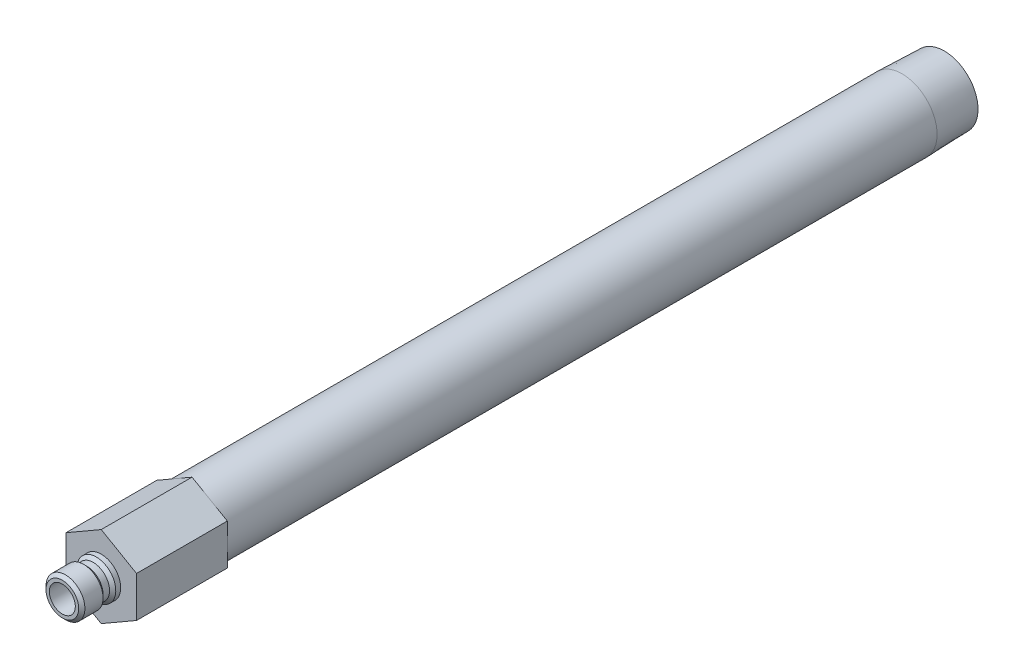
ISO-10303-21;
HEADER;
FILE_DESCRIPTION(('STEP AP214'),'2;1');
FILE_NAME('part.step','',(''),(''),'','','');
FILE_SCHEMA(('AUTOMOTIVE_DESIGN { 1 0 10303 214 1 1 1 1 }'));
ENDSEC;
DATA;
#1=APPLICATION_CONTEXT('core data for automotive mechanical design processes');
#2=APPLICATION_PROTOCOL_DEFINITION('international standard','automotive_design',2000,#1);
#3=PRODUCT_CONTEXT('',#1,'mechanical');
#4=PRODUCT('Part','Part','',(#3));
#5=PRODUCT_RELATED_PRODUCT_CATEGORY('part','',(#4));
#6=PRODUCT_DEFINITION_FORMATION('','',#4);
#7=PRODUCT_DEFINITION_CONTEXT('part definition',#1,'design');
#8=PRODUCT_DEFINITION('design','',#6,#7);
#9=PRODUCT_DEFINITION_SHAPE('','',#8);
#10=(LENGTH_UNIT() NAMED_UNIT(*) SI_UNIT(.MILLI.,.METRE.));
#11=(NAMED_UNIT(*) PLANE_ANGLE_UNIT() SI_UNIT($,.RADIAN.));
#12=(NAMED_UNIT(*) SI_UNIT($,.STERADIAN.) SOLID_ANGLE_UNIT());
#13=UNCERTAINTY_MEASURE_WITH_UNIT(LENGTH_MEASURE(1.E-05),#10,'distance_accuracy_value','');
#14=(GEOMETRIC_REPRESENTATION_CONTEXT(3) GLOBAL_UNCERTAINTY_ASSIGNED_CONTEXT((#13)) GLOBAL_UNIT_ASSIGNED_CONTEXT((#10,
#11,#12)) REPRESENTATION_CONTEXT('',''));
#15=CARTESIAN_POINT('',(0.,0.,0.));
#16=DIRECTION('',(0.,0.,1.));
#17=DIRECTION('',(1.,0.,0.));
#18=AXIS2_PLACEMENT_3D('',#15,#16,#17);
#19=CARTESIAN_POINT('',(0.,0.,0.));
#20=DIRECTION('',(0.,0.,-1.));
#21=DIRECTION('',(0.,1.,0.));
#22=AXIS2_PLACEMENT_3D('',#19,#20,#21);
#23=CYLINDRICAL_SURFACE('',#22,8.57249999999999);
#24=CARTESIAN_POINT('',(0.,0.,-196.0372));
#25=DIRECTION('',(0.,0.,-1.));
#26=DIRECTION('',(0.,1.,0.));
#27=AXIS2_PLACEMENT_3D('',#24,#25,#26);
#28=CIRCLE('',#27,8.57249999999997);
#29=CARTESIAN_POINT('',(0.,8.5725,-196.0372));
#30=VERTEX_POINT('',#29);
#31=EDGE_CURVE('E168',#30,#30,#28,.T.);
#32=ORIENTED_EDGE('',*,*,#31,.F.);
#33=EDGE_LOOP('',(#32));
#34=FACE_BOUND('',#33,.T.);
#35=CARTESIAN_POINT('',(0.,0.,-22.225));
#36=DIRECTION('',(0.,0.,1.));
#37=DIRECTION('',(1.,0.,0.));
#38=AXIS2_PLACEMENT_3D('',#35,#36,#37);
#39=CIRCLE('',#38,8.57249999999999);
#40=CARTESIAN_POINT('',(8.57249999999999,0.,-22.225));
#41=VERTEX_POINT('',#40);
#42=EDGE_CURVE('E37',#41,#41,#39,.F.);
#43=ORIENTED_EDGE('',*,*,#42,.T.);
#44=EDGE_LOOP('',(#43));
#45=FACE_BOUND('',#44,.T.);
#46=ADVANCED_FACE('F33',(#34,#45),#23,.T.);
#47=CARTESIAN_POINT('',(0.,0.,0.));
#48=DIRECTION('',(0.,0.,-1.));
#49=DIRECTION('',(0.,1.,0.));
#50=AXIS2_PLACEMENT_3D('',#47,#48,#49);
#51=CYLINDRICAL_SURFACE('',#50,3.175);
#52=CARTESIAN_POINT('',(0.,0.,9.525));
#53=DIRECTION('',(0.,0.,-1.));
#54=DIRECTION('',(0.,1.,0.));
#55=AXIS2_PLACEMENT_3D('',#52,#53,#54);
#56=CIRCLE('',#55,3.175);
#57=CARTESIAN_POINT('',(0.,3.175,9.525));
#58=VERTEX_POINT('',#57);
#59=EDGE_CURVE('E144',#58,#58,#56,.T.);
#60=ORIENTED_EDGE('',*,*,#59,.F.);
#61=EDGE_LOOP('',(#60));
#62=FACE_BOUND('',#61,.T.);
#63=CARTESIAN_POINT('',(0.,0.,-22.225));
#64=DIRECTION('',(0.,0.,-1.));
#65=DIRECTION('',(0.,1.,0.));
#66=AXIS2_PLACEMENT_3D('',#63,#64,#65);
#67=CIRCLE('',#66,3.17499999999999);
#68=CARTESIAN_POINT('',(0.,3.175,-22.225));
#69=VERTEX_POINT('',#68);
#70=EDGE_CURVE('E11',#69,#69,#67,.T.);
#71=ORIENTED_EDGE('',*,*,#70,.T.);
#72=EDGE_LOOP('',(#71));
#73=FACE_BOUND('',#72,.T.);
#74=ADVANCED_FACE('F35',(#62,#73),#51,.F.);
#75=CARTESIAN_POINT('',(0.,3.175,-22.225));
#76=DIRECTION('',(0.,0.,-1.));
#77=DIRECTION('',(0.,1.,0.));
#78=AXIS2_PLACEMENT_3D('',#75,#76,#77);
#79=PLANE('',#78);
#80=CARTESIAN_POINT('',(0.,0.,-22.225));
#81=DIRECTION('',(0.,0.,-1.));
#82=DIRECTION('',(0.,1.,0.));
#83=AXIS2_PLACEMENT_3D('',#80,#81,#82);
#84=CIRCLE('',#83,6.2611);
#85=CARTESIAN_POINT('',(0.,6.2611,-22.225));
#86=VERTEX_POINT('',#85);
#87=EDGE_CURVE('E43',#86,#86,#84,.T.);
#88=ORIENTED_EDGE('',*,*,#87,.T.);
#89=EDGE_LOOP('',(#88));
#90=FACE_BOUND('',#89,.T.);
#91=ORIENTED_EDGE('',*,*,#70,.F.);
#92=EDGE_LOOP('',(#91));
#93=FACE_BOUND('',#92,.T.);
#94=ADVANCED_FACE('F180',(#90,#93),#79,.T.);
#95=CARTESIAN_POINT('',(0.,0.,0.));
#96=DIRECTION('',(0.,0.,-1.));
#97=DIRECTION('',(0.,1.,0.));
#98=AXIS2_PLACEMENT_3D('',#95,#96,#97);
#99=CYLINDRICAL_SURFACE('',#98,6.26109999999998);
#100=CARTESIAN_POINT('',(0.,0.,-206.375));
#101=DIRECTION('',(0.,0.,-1.));
#102=DIRECTION('',(0.,1.,0.));
#103=AXIS2_PLACEMENT_3D('',#100,#101,#102);
#104=CIRCLE('',#103,6.26109999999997);
#105=CARTESIAN_POINT('',(0.,6.2611,-206.375));
#106=VERTEX_POINT('',#105);
#107=EDGE_CURVE('E174',#106,#106,#104,.T.);
#108=ORIENTED_EDGE('',*,*,#107,.T.);
#109=EDGE_LOOP('',(#108));
#110=FACE_BOUND('',#109,.T.);
#111=ORIENTED_EDGE('',*,*,#87,.F.);
#112=EDGE_LOOP('',(#111));
#113=FACE_BOUND('',#112,.T.);
#114=ADVANCED_FACE('F183',(#110,#113),#99,.F.);
#115=CARTESIAN_POINT('',(0.,8.24944566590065,-206.375));
#116=DIRECTION('',(0.,0.,-1.));
#117=DIRECTION('',(0.,1.,0.));
#118=AXIS2_PLACEMENT_3D('',#115,#116,#117);
#119=PLANE('',#118);
#120=CARTESIAN_POINT('',(0.,0.,-206.375));
#121=DIRECTION('',(0.,0.,-1.));
#122=DIRECTION('',(0.,1.,0.));
#123=AXIS2_PLACEMENT_3D('',#120,#121,#122);
#124=CIRCLE('',#123,8.24944566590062);
#125=CARTESIAN_POINT('',(0.,8.24944566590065,-206.375));
#126=VERTEX_POINT('',#125);
#127=EDGE_CURVE('E171',#126,#126,#124,.T.);
#128=ORIENTED_EDGE('',*,*,#127,.T.);
#129=EDGE_LOOP('',(#128));
#130=FACE_BOUND('',#129,.T.);
#131=ORIENTED_EDGE('',*,*,#107,.F.);
#132=EDGE_LOOP('',(#131));
#133=FACE_BOUND('',#132,.T.);
#134=ADVANCED_FACE('F185',(#130,#133),#119,.T.);
#135=CARTESIAN_POINT('',(0.,0.,-206.375));
#136=DIRECTION('',(0.,0.,1.));
#137=DIRECTION('',(0.,-1.,0.));
#138=AXIS2_PLACEMENT_3D('',#135,#136,#137);
#139=CONICAL_SURFACE('',#138,8.24944566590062,0.0312396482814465);
#140=ORIENTED_EDGE('',*,*,#31,.T.);
#141=EDGE_LOOP('',(#140));
#142=FACE_BOUND('',#141,.T.);
#143=ORIENTED_EDGE('',*,*,#127,.F.);
#144=EDGE_LOOP('',(#143));
#145=FACE_BOUND('',#144,.T.);
#146=ADVANCED_FACE('F192',(#142,#145),#139,.T.);
#147=CARTESIAN_POINT('',(0.,4.7625,0.));
#148=DIRECTION('',(0.,0.,1.));
#149=DIRECTION('',(0.,-1.,0.));
#150=AXIS2_PLACEMENT_3D('',#147,#148,#149);
#151=PLANE('',#150);
#152=CARTESIAN_POINT('',(0.,0.,0.));
#153=DIRECTION('',(0.,0.,-1.));
#154=DIRECTION('',(0.,1.,0.));
#155=AXIS2_PLACEMENT_3D('',#152,#153,#154);
#156=CIRCLE('',#155,4.7625);
#157=CARTESIAN_POINT('',(0.,4.7625,0.));
#158=VERTEX_POINT('',#157);
#159=EDGE_CURVE('E165',#158,#158,#156,.T.);
#160=ORIENTED_EDGE('',*,*,#159,.T.);
#161=EDGE_LOOP('',(#160));
#162=FACE_BOUND('',#161,.T.);
#163=DIRECTION('',(-0.866025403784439,-0.5,0.));
#164=VECTOR('',#163,1.);
#165=CARTESIAN_POINT('',(0.,9.97199384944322,0.));
#166=LINE('',#165,#164);
#167=CARTESIAN_POINT('',(0.,9.97199384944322,0.));
#168=VERTEX_POINT('',#167);
#169=CARTESIAN_POINT('',(-8.636,4.98599692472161,0.));
#170=VERTEX_POINT('',#169);
#171=EDGE_CURVE('E122',#168,#170,#166,.T.);
#172=ORIENTED_EDGE('',*,*,#171,.T.);
#173=DIRECTION('',(0.,-1.,0.));
#174=VECTOR('',#173,1.);
#175=CARTESIAN_POINT('',(-8.636,4.98599692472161,0.));
#176=LINE('',#175,#174);
#177=CARTESIAN_POINT('',(-8.636,-4.98599692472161,0.));
#178=VERTEX_POINT('',#177);
#179=EDGE_CURVE('E125',#170,#178,#176,.T.);
#180=ORIENTED_EDGE('',*,*,#179,.T.);
#181=DIRECTION('',(0.866025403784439,-0.5,0.));
#182=VECTOR('',#181,1.);
#183=CARTESIAN_POINT('',(-8.636,-4.98599692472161,0.));
#184=LINE('',#183,#182);
#185=CARTESIAN_POINT('',(0.,-9.97199384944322,0.));
#186=VERTEX_POINT('',#185);
#187=EDGE_CURVE('E128',#178,#186,#184,.T.);
#188=ORIENTED_EDGE('',*,*,#187,.T.);
#189=DIRECTION('',(0.866025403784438,0.5,0.));
#190=VECTOR('',#189,1.);
#191=CARTESIAN_POINT('',(0.,-9.97199384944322,0.));
#192=LINE('',#191,#190);
#193=CARTESIAN_POINT('',(8.636,-4.98599692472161,0.));
#194=VERTEX_POINT('',#193);
#195=EDGE_CURVE('E131',#186,#194,#192,.T.);
#196=ORIENTED_EDGE('',*,*,#195,.T.);
#197=DIRECTION('',(0.,1.,0.));
#198=VECTOR('',#197,1.);
#199=CARTESIAN_POINT('',(8.636,-4.98599692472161,0.));
#200=LINE('',#199,#198);
#201=CARTESIAN_POINT('',(8.636,4.98599692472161,0.));
#202=VERTEX_POINT('',#201);
#203=EDGE_CURVE('E99',#194,#202,#200,.T.);
#204=ORIENTED_EDGE('',*,*,#203,.T.);
#205=DIRECTION('',(-0.866025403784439,0.5,0.));
#206=VECTOR('',#205,1.);
#207=CARTESIAN_POINT('',(8.636,4.98599692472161,0.));
#208=LINE('',#207,#206);
#209=EDGE_CURVE('E134',#202,#168,#208,.T.);
#210=ORIENTED_EDGE('',*,*,#209,.T.);
#211=EDGE_LOOP('',(#172,#180,#188,#196,#204,#210));
#212=FACE_BOUND('',#211,.T.);
#213=ADVANCED_FACE('F206',(#162,#212),#151,.T.);
#214=CARTESIAN_POINT('',(0.,0.,0.));
#215=DIRECTION('',(0.,0.,-1.));
#216=DIRECTION('',(0.,1.,0.));
#217=AXIS2_PLACEMENT_3D('',#214,#215,#216);
#218=CYLINDRICAL_SURFACE('',#217,4.7625);
#219=CARTESIAN_POINT('',(0.,0.,1.2065));
#220=DIRECTION('',(0.,0.,-1.));
#221=DIRECTION('',(0.,1.,0.));
#222=AXIS2_PLACEMENT_3D('',#219,#220,#221);
#223=CIRCLE('',#222,4.7625);
#224=CARTESIAN_POINT('',(0.,4.7625,1.2065));
#225=VERTEX_POINT('',#224);
#226=EDGE_CURVE('E162',#225,#225,#223,.T.);
#227=ORIENTED_EDGE('',*,*,#226,.T.);
#228=EDGE_LOOP('',(#227));
#229=FACE_BOUND('',#228,.T.);
#230=ORIENTED_EDGE('',*,*,#159,.F.);
#231=EDGE_LOOP('',(#230));
#232=FACE_BOUND('',#231,.T.);
#233=ADVANCED_FACE('F213',(#229,#232),#218,.T.);
#234=CARTESIAN_POINT('',(0.,0.,1.2065));
#235=DIRECTION('',(0.,0.,-1.));
#236=DIRECTION('',(0.,1.,0.));
#237=AXIS2_PLACEMENT_3D('',#234,#235,#236);
#238=CONICAL_SURFACE('',#237,4.7625,0.785398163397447);
#239=CARTESIAN_POINT('',(0.,0.,1.9685));
#240=DIRECTION('',(0.,0.,-1.));
#241=DIRECTION('',(0.,1.,0.));
#242=AXIS2_PLACEMENT_3D('',#239,#240,#241);
#243=CIRCLE('',#242,4.0005);
#244=CARTESIAN_POINT('',(0.,4.0005,1.9685));
#245=VERTEX_POINT('',#244);
#246=EDGE_CURVE('E159',#245,#245,#243,.T.);
#247=ORIENTED_EDGE('',*,*,#246,.T.);
#248=EDGE_LOOP('',(#247));
#249=FACE_BOUND('',#248,.T.);
#250=ORIENTED_EDGE('',*,*,#226,.F.);
#251=EDGE_LOOP('',(#250));
#252=FACE_BOUND('',#251,.T.);
#253=ADVANCED_FACE('F222',(#249,#252),#238,.T.);
#254=CARTESIAN_POINT('',(0.,0.,0.));
#255=DIRECTION('',(0.,0.,-1.));
#256=DIRECTION('',(0.,1.,0.));
#257=AXIS2_PLACEMENT_3D('',#254,#255,#256);
#258=CYLINDRICAL_SURFACE('',#257,4.0005);
#259=CARTESIAN_POINT('',(0.,0.,3.556));
#260=DIRECTION('',(0.,0.,-1.));
#261=DIRECTION('',(0.,1.,0.));
#262=AXIS2_PLACEMENT_3D('',#259,#260,#261);
#263=CIRCLE('',#262,4.0005);
#264=CARTESIAN_POINT('',(0.,4.0005,3.556));
#265=VERTEX_POINT('',#264);
#266=EDGE_CURVE('E156',#265,#265,#263,.T.);
#267=ORIENTED_EDGE('',*,*,#266,.T.);
#268=EDGE_LOOP('',(#267));
#269=FACE_BOUND('',#268,.T.);
#270=ORIENTED_EDGE('',*,*,#246,.F.);
#271=EDGE_LOOP('',(#270));
#272=FACE_BOUND('',#271,.T.);
#273=ADVANCED_FACE('F263',(#269,#272),#258,.T.);
#274=CARTESIAN_POINT('',(0.,0.,3.556));
#275=DIRECTION('',(0.,0.,1.));
#276=DIRECTION('',(0.,-1.,0.));
#277=AXIS2_PLACEMENT_3D('',#274,#275,#276);
#278=CONICAL_SURFACE('',#277,4.0005,0.785398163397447);
#279=CARTESIAN_POINT('',(0.,0.,4.318));
#280=DIRECTION('',(0.,0.,-1.));
#281=DIRECTION('',(0.,1.,0.));
#282=AXIS2_PLACEMENT_3D('',#279,#280,#281);
#283=CIRCLE('',#282,4.7625);
#284=CARTESIAN_POINT('',(0.,4.7625,4.318));
#285=VERTEX_POINT('',#284);
#286=EDGE_CURVE('E153',#285,#285,#283,.T.);
#287=ORIENTED_EDGE('',*,*,#286,.T.);
#288=EDGE_LOOP('',(#287));
#289=FACE_BOUND('',#288,.T.);
#290=ORIENTED_EDGE('',*,*,#266,.F.);
#291=EDGE_LOOP('',(#290));
#292=FACE_BOUND('',#291,.T.);
#293=ADVANCED_FACE('F259',(#289,#292),#278,.T.);
#294=CARTESIAN_POINT('',(0.,0.,0.));
#295=DIRECTION('',(0.,0.,-1.));
#296=DIRECTION('',(0.,1.,0.));
#297=AXIS2_PLACEMENT_3D('',#294,#295,#296);
#298=CYLINDRICAL_SURFACE('',#297,4.7625);
#299=CARTESIAN_POINT('',(0.,0.,8.763));
#300=DIRECTION('',(0.,0.,-1.));
#301=DIRECTION('',(0.,1.,0.));
#302=AXIS2_PLACEMENT_3D('',#299,#300,#301);
#303=CIRCLE('',#302,4.7625);
#304=CARTESIAN_POINT('',(0.,4.7625,8.763));
#305=VERTEX_POINT('',#304);
#306=EDGE_CURVE('E150',#305,#305,#303,.T.);
#307=ORIENTED_EDGE('',*,*,#306,.T.);
#308=EDGE_LOOP('',(#307));
#309=FACE_BOUND('',#308,.T.);
#310=ORIENTED_EDGE('',*,*,#286,.F.);
#311=EDGE_LOOP('',(#310));
#312=FACE_BOUND('',#311,.T.);
#313=ADVANCED_FACE('F255',(#309,#312),#298,.T.);
#314=CARTESIAN_POINT('',(0.,0.,8.763));
#315=DIRECTION('',(0.,0.,-1.));
#316=DIRECTION('',(0.,1.,0.));
#317=AXIS2_PLACEMENT_3D('',#314,#315,#316);
#318=CONICAL_SURFACE('',#317,4.7625,0.785398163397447);
#319=CARTESIAN_POINT('',(0.,0.,9.525));
#320=DIRECTION('',(0.,0.,-1.));
#321=DIRECTION('',(0.,1.,0.));
#322=AXIS2_PLACEMENT_3D('',#319,#320,#321);
#323=CIRCLE('',#322,4.0005);
#324=CARTESIAN_POINT('',(0.,4.0005,9.525));
#325=VERTEX_POINT('',#324);
#326=EDGE_CURVE('E147',#325,#325,#323,.T.);
#327=ORIENTED_EDGE('',*,*,#326,.T.);
#328=EDGE_LOOP('',(#327));
#329=FACE_BOUND('',#328,.T.);
#330=ORIENTED_EDGE('',*,*,#306,.F.);
#331=EDGE_LOOP('',(#330));
#332=FACE_BOUND('',#331,.T.);
#333=ADVANCED_FACE('F251',(#329,#332),#318,.T.);
#334=CARTESIAN_POINT('',(0.,3.175,9.525));
#335=DIRECTION('',(0.,0.,1.));
#336=DIRECTION('',(0.,-1.,0.));
#337=AXIS2_PLACEMENT_3D('',#334,#335,#336);
#338=PLANE('',#337);
#339=ORIENTED_EDGE('',*,*,#59,.T.);
#340=EDGE_LOOP('',(#339));
#341=FACE_BOUND('',#340,.T.);
#342=ORIENTED_EDGE('',*,*,#326,.F.);
#343=EDGE_LOOP('',(#342));
#344=FACE_BOUND('',#343,.T.);
#345=ADVANCED_FACE('F239',(#341,#344),#338,.T.);
#346=CARTESIAN_POINT('',(0.,9.97199384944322,-22.225));
#347=DIRECTION('',(-0.5,0.866025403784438,0.));
#348=DIRECTION('',(-0.866025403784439,-0.5,0.));
#349=AXIS2_PLACEMENT_3D('',#346,#347,#348);
#350=PLANE('',#349);
#351=ORIENTED_EDGE('',*,*,#171,.F.);
#352=DIRECTION('',(0.,0.,1.));
#353=VECTOR('',#352,1.);
#354=CARTESIAN_POINT('',(0.,9.97199384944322,-22.225));
#355=LINE('',#354,#353);
#356=CARTESIAN_POINT('',(0.,9.97199384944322,-22.225));
#357=VERTEX_POINT('',#356);
#358=EDGE_CURVE('E51',#357,#168,#355,.T.);
#359=ORIENTED_EDGE('',*,*,#358,.F.);
#360=DIRECTION('',(-0.866025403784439,-0.5,0.));
#361=VECTOR('',#360,1.);
#362=CARTESIAN_POINT('',(0.,9.97199384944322,-22.225));
#363=LINE('',#362,#361);
#364=CARTESIAN_POINT('',(-8.636,4.98599692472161,-22.225));
#365=VERTEX_POINT('',#364);
#366=EDGE_CURVE('E137',#357,#365,#363,.T.);
#367=ORIENTED_EDGE('',*,*,#366,.T.);
#368=DIRECTION('',(0.,0.,1.));
#369=VECTOR('',#368,1.);
#370=CARTESIAN_POINT('',(-8.636,4.98599692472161,-22.225));
#371=LINE('',#370,#369);
#372=EDGE_CURVE('E86',#365,#170,#371,.T.);
#373=ORIENTED_EDGE('',*,*,#372,.T.);
#374=EDGE_LOOP('',(#351,#359,#367,#373));
#375=FACE_BOUND('',#374,.T.);
#376=ADVANCED_FACE('F226',(#375),#350,.T.);
#377=CARTESIAN_POINT('',(8.636,4.98599692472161,-22.225));
#378=DIRECTION('',(0.5,0.866025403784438,0.));
#379=DIRECTION('',(-0.866025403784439,0.5,0.));
#380=AXIS2_PLACEMENT_3D('',#377,#378,#379);
#381=PLANE('',#380);
#382=ORIENTED_EDGE('',*,*,#209,.F.);
#383=DIRECTION('',(0.,0.,1.));
#384=VECTOR('',#383,1.);
#385=CARTESIAN_POINT('',(8.636,4.98599692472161,-22.225));
#386=LINE('',#385,#384);
#387=CARTESIAN_POINT('',(8.636,4.98599692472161,-22.225));
#388=VERTEX_POINT('',#387);
#389=EDGE_CURVE('E74',#388,#202,#386,.T.);
#390=ORIENTED_EDGE('',*,*,#389,.F.);
#391=DIRECTION('',(-0.866025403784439,0.5,0.));
#392=VECTOR('',#391,1.);
#393=CARTESIAN_POINT('',(8.636,4.98599692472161,-22.225));
#394=LINE('',#393,#392);
#395=EDGE_CURVE('E112',#388,#357,#394,.T.);
#396=ORIENTED_EDGE('',*,*,#395,.T.);
#397=ORIENTED_EDGE('',*,*,#358,.T.);
#398=EDGE_LOOP('',(#382,#390,#396,#397));
#399=FACE_BOUND('',#398,.T.);
#400=ADVANCED_FACE('F231',(#399),#381,.T.);
#401=CARTESIAN_POINT('',(8.636,-4.98599692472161,-22.225));
#402=DIRECTION('',(1.,0.,0.));
#403=DIRECTION('',(0.,1.,0.));
#404=AXIS2_PLACEMENT_3D('',#401,#402,#403);
#405=PLANE('',#404);
#406=ORIENTED_EDGE('',*,*,#203,.F.);
#407=DIRECTION('',(0.,0.,1.));
#408=VECTOR('',#407,1.);
#409=CARTESIAN_POINT('',(8.636,-4.98599692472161,-22.225));
#410=LINE('',#409,#408);
#411=CARTESIAN_POINT('',(8.636,-4.98599692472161,-22.225));
#412=VERTEX_POINT('',#411);
#413=EDGE_CURVE('E94',#412,#194,#410,.T.);
#414=ORIENTED_EDGE('',*,*,#413,.F.);
#415=DIRECTION('',(0.,1.,0.));
#416=VECTOR('',#415,1.);
#417=CARTESIAN_POINT('',(8.636,-4.98599692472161,-22.225));
#418=LINE('',#417,#416);
#419=EDGE_CURVE('E97',#412,#388,#418,.T.);
#420=ORIENTED_EDGE('',*,*,#419,.T.);
#421=ORIENTED_EDGE('',*,*,#389,.T.);
#422=EDGE_LOOP('',(#406,#414,#420,#421));
#423=FACE_BOUND('',#422,.T.);
#424=ADVANCED_FACE('F96',(#423),#405,.T.);
#425=CARTESIAN_POINT('',(0.,-9.97199384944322,-22.225));
#426=DIRECTION('',(0.5,-0.866025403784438,0.));
#427=DIRECTION('',(0.866025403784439,0.5,0.));
#428=AXIS2_PLACEMENT_3D('',#425,#426,#427);
#429=PLANE('',#428);
#430=ORIENTED_EDGE('',*,*,#195,.F.);
#431=DIRECTION('',(0.,0.,1.));
#432=VECTOR('',#431,1.);
#433=CARTESIAN_POINT('',(0.,-9.97199384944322,-22.225));
#434=LINE('',#433,#432);
#435=CARTESIAN_POINT('',(0.,-9.97199384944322,-22.225));
#436=VERTEX_POINT('',#435);
#437=EDGE_CURVE('E104',#436,#186,#434,.T.);
#438=ORIENTED_EDGE('',*,*,#437,.F.);
#439=DIRECTION('',(0.866025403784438,0.5,0.));
#440=VECTOR('',#439,1.);
#441=CARTESIAN_POINT('',(0.,-9.97199384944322,-22.225));
#442=LINE('',#441,#440);
#443=EDGE_CURVE('E110',#436,#412,#442,.T.);
#444=ORIENTED_EDGE('',*,*,#443,.T.);
#445=ORIENTED_EDGE('',*,*,#413,.T.);
#446=EDGE_LOOP('',(#430,#438,#444,#445));
#447=FACE_BOUND('',#446,.T.);
#448=ADVANCED_FACE('F114',(#447),#429,.T.);
#449=CARTESIAN_POINT('',(-8.636,-4.98599692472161,-22.225));
#450=DIRECTION('',(-0.5,-0.866025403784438,0.));
#451=DIRECTION('',(0.866025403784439,-0.5,0.));
#452=AXIS2_PLACEMENT_3D('',#449,#450,#451);
#453=PLANE('',#452);
#454=ORIENTED_EDGE('',*,*,#187,.F.);
#455=DIRECTION('',(0.,0.,1.));
#456=VECTOR('',#455,1.);
#457=CARTESIAN_POINT('',(-8.636,-4.98599692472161,-22.225));
#458=LINE('',#457,#456);
#459=CARTESIAN_POINT('',(-8.636,-4.98599692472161,-22.225));
#460=VERTEX_POINT('',#459);
#461=EDGE_CURVE('E141',#460,#178,#458,.T.);
#462=ORIENTED_EDGE('',*,*,#461,.F.);
#463=DIRECTION('',(0.866025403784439,-0.5,0.));
#464=VECTOR('',#463,1.);
#465=CARTESIAN_POINT('',(-8.636,-4.98599692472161,-22.225));
#466=LINE('',#465,#464);
#467=EDGE_CURVE('E115',#460,#436,#466,.T.);
#468=ORIENTED_EDGE('',*,*,#467,.T.);
#469=ORIENTED_EDGE('',*,*,#437,.T.);
#470=EDGE_LOOP('',(#454,#462,#468,#469));
#471=FACE_BOUND('',#470,.T.);
#472=ADVANCED_FACE('F230',(#471),#453,.T.);
#473=CARTESIAN_POINT('',(-8.636,4.98599692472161,-22.225));
#474=DIRECTION('',(-1.,0.,0.));
#475=DIRECTION('',(0.,0.,1.));
#476=AXIS2_PLACEMENT_3D('',#473,#474,#475);
#477=PLANE('',#476);
#478=ORIENTED_EDGE('',*,*,#179,.F.);
#479=ORIENTED_EDGE('',*,*,#372,.F.);
#480=DIRECTION('',(0.,-1.,0.));
#481=VECTOR('',#480,1.);
#482=CARTESIAN_POINT('',(-8.636,4.98599692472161,-22.225));
#483=LINE('',#482,#481);
#484=EDGE_CURVE('E117',#365,#460,#483,.T.);
#485=ORIENTED_EDGE('',*,*,#484,.T.);
#486=ORIENTED_EDGE('',*,*,#461,.T.);
#487=EDGE_LOOP('',(#478,#479,#485,#486));
#488=FACE_BOUND('',#487,.T.);
#489=ADVANCED_FACE('F227',(#488),#477,.T.);
#490=CARTESIAN_POINT('',(-8.636,4.98599692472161,-22.225));
#491=DIRECTION('',(0.,0.,1.));
#492=DIRECTION('',(1.,0.,0.));
#493=AXIS2_PLACEMENT_3D('',#490,#491,#492);
#494=PLANE('',#493);
#495=ORIENTED_EDGE('',*,*,#42,.F.);
#496=EDGE_LOOP('',(#495));
#497=FACE_BOUND('',#496,.T.);
#498=ORIENTED_EDGE('',*,*,#366,.F.);
#499=ORIENTED_EDGE('',*,*,#395,.F.);
#500=ORIENTED_EDGE('',*,*,#419,.F.);
#501=ORIENTED_EDGE('',*,*,#443,.F.);
#502=ORIENTED_EDGE('',*,*,#467,.F.);
#503=ORIENTED_EDGE('',*,*,#484,.F.);
#504=EDGE_LOOP('',(#498,#499,#500,#501,#502,#503));
#505=FACE_BOUND('',#504,.T.);
#506=ADVANCED_FACE('F108',(#497,#505),#494,.F.);
#507=CLOSED_SHELL('',(#46,#74,#94,#114,#134,#146,#213,#233,#253,#273,#293,#313,#333,#345,#376,
#400,#424,#448,#472,#489,#506));
#508=MANIFOLD_SOLID_BREP('B2',#507);
#509=ADVANCED_BREP_SHAPE_REPRESENTATION('',(#18,#508),#14);
#510=SHAPE_DEFINITION_REPRESENTATION(#9,#509);
ENDSEC;
END-ISO-10303-21;
